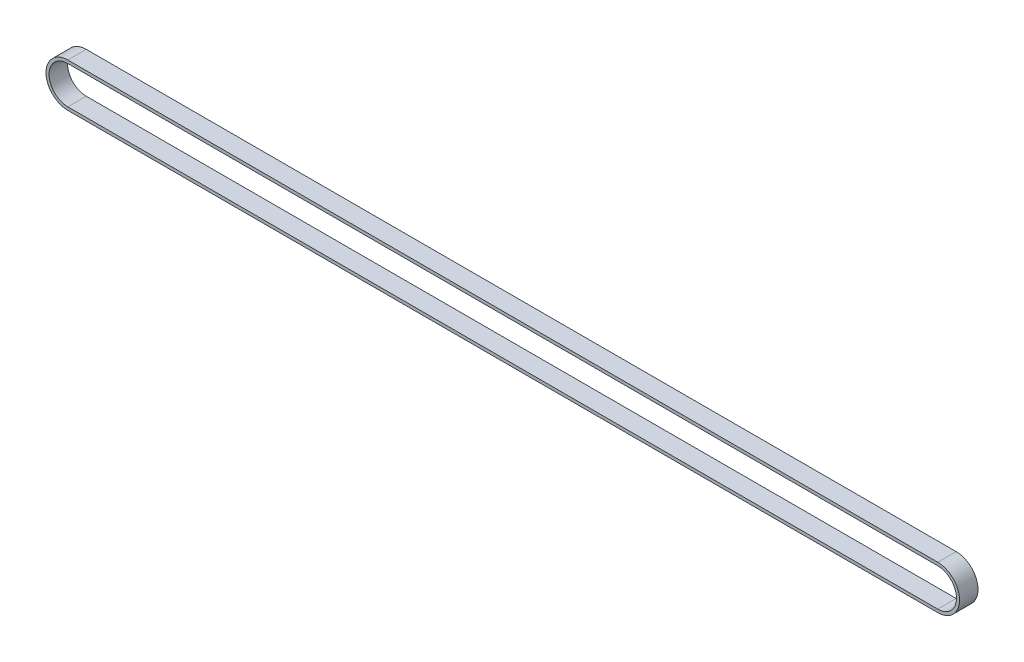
ISO-10303-21;
HEADER;
FILE_DESCRIPTION(('STEP AP214'),'2;1');
FILE_NAME('part.step','',(''),(''),'','','');
FILE_SCHEMA(('AUTOMOTIVE_DESIGN { 1 0 10303 214 1 1 1 1 }'));
ENDSEC;
DATA;
#1=APPLICATION_CONTEXT('core data for automotive mechanical design processes');
#2=APPLICATION_PROTOCOL_DEFINITION('international standard','automotive_design',2000,#1);
#3=PRODUCT_CONTEXT('',#1,'mechanical');
#4=PRODUCT('Part','Part','',(#3));
#5=PRODUCT_RELATED_PRODUCT_CATEGORY('part','',(#4));
#6=PRODUCT_DEFINITION_FORMATION('','',#4);
#7=PRODUCT_DEFINITION_CONTEXT('part definition',#1,'design');
#8=PRODUCT_DEFINITION('design','',#6,#7);
#9=PRODUCT_DEFINITION_SHAPE('','',#8);
#10=(LENGTH_UNIT() NAMED_UNIT(*) SI_UNIT(.MILLI.,.METRE.));
#11=(NAMED_UNIT(*) PLANE_ANGLE_UNIT() SI_UNIT($,.RADIAN.));
#12=(NAMED_UNIT(*) SI_UNIT($,.STERADIAN.) SOLID_ANGLE_UNIT());
#13=UNCERTAINTY_MEASURE_WITH_UNIT(LENGTH_MEASURE(1.E-05),#10,'distance_accuracy_value','');
#14=(GEOMETRIC_REPRESENTATION_CONTEXT(3) GLOBAL_UNCERTAINTY_ASSIGNED_CONTEXT((#13)) GLOBAL_UNIT_ASSIGNED_CONTEXT((#10,
#11,#12)) REPRESENTATION_CONTEXT('',''));
#15=CARTESIAN_POINT('',(0.,0.,0.));
#16=DIRECTION('',(0.,0.,1.));
#17=DIRECTION('',(1.,0.,0.));
#18=AXIS2_PLACEMENT_3D('',#15,#16,#17);
#19=CARTESIAN_POINT('',(0.,0.,6.));
#20=DIRECTION('',(0.,0.,1.));
#21=DIRECTION('',(1.,0.,0.));
#22=AXIS2_PLACEMENT_3D('',#19,#20,#21);
#23=PLANE('',#22);
#24=CARTESIAN_POINT('',(0.,0.,6.));
#25=DIRECTION('',(0.,0.,1.));
#26=DIRECTION('',(1.,0.,0.));
#27=AXIS2_PLACEMENT_3D('',#24,#25,#26);
#28=CIRCLE('',#27,7.1);
#29=CARTESIAN_POINT('',(0.,7.1,6.));
#30=VERTEX_POINT('',#29);
#31=CARTESIAN_POINT('',(0.,-7.1,6.));
#32=VERTEX_POINT('',#31);
#33=EDGE_CURVE('E136',#30,#32,#28,.T.);
#34=ORIENTED_EDGE('',*,*,#33,.T.);
#35=DIRECTION('',(1.,0.,0.));
#36=VECTOR('',#35,1.);
#37=CARTESIAN_POINT('',(0.,-7.1,6.));
#38=LINE('',#37,#36);
#39=CARTESIAN_POINT('',(283.,-7.1,6.));
#40=VERTEX_POINT('',#39);
#41=EDGE_CURVE('E139',#32,#40,#38,.T.);
#42=ORIENTED_EDGE('',*,*,#41,.T.);
#43=CARTESIAN_POINT('',(283.,0.,6.));
#44=DIRECTION('',(0.,0.,1.));
#45=DIRECTION('',(1.,0.,0.));
#46=AXIS2_PLACEMENT_3D('',#43,#44,#45);
#47=CIRCLE('',#46,7.1);
#48=CARTESIAN_POINT('',(283.,7.1,6.));
#49=VERTEX_POINT('',#48);
#50=EDGE_CURVE('E142',#40,#49,#47,.T.);
#51=ORIENTED_EDGE('',*,*,#50,.T.);
#52=DIRECTION('',(-1.,0.,0.));
#53=VECTOR('',#52,1.);
#54=CARTESIAN_POINT('',(0.,7.1,6.));
#55=LINE('',#54,#53);
#56=EDGE_CURVE('E144',#49,#30,#55,.T.);
#57=ORIENTED_EDGE('',*,*,#56,.T.);
#58=EDGE_LOOP('',(#34,#42,#51,#57));
#59=FACE_BOUND('',#58,.T.);
#60=DIRECTION('',(1.,0.,0.));
#61=VECTOR('',#60,1.);
#62=CARTESIAN_POINT('',(0.,-6.1,6.));
#63=LINE('',#62,#61);
#64=CARTESIAN_POINT('',(0.,-6.1,6.));
#65=VERTEX_POINT('',#64);
#66=CARTESIAN_POINT('',(283.,-6.1,6.));
#67=VERTEX_POINT('',#66);
#68=EDGE_CURVE('E108',#65,#67,#63,.T.);
#69=ORIENTED_EDGE('',*,*,#68,.F.);
#70=CARTESIAN_POINT('',(0.,0.,6.));
#71=DIRECTION('',(0.,0.,1.));
#72=DIRECTION('',(1.,0.,0.));
#73=AXIS2_PLACEMENT_3D('',#70,#71,#72);
#74=CIRCLE('',#73,6.1);
#75=CARTESIAN_POINT('',(0.,6.1,6.));
#76=VERTEX_POINT('',#75);
#77=EDGE_CURVE('E100',#76,#65,#74,.T.);
#78=ORIENTED_EDGE('',*,*,#77,.F.);
#79=DIRECTION('',(-1.,0.,0.));
#80=VECTOR('',#79,1.);
#81=CARTESIAN_POINT('',(0.,6.1,6.));
#82=LINE('',#81,#80);
#83=CARTESIAN_POINT('',(283.,6.1,6.));
#84=VERTEX_POINT('',#83);
#85=EDGE_CURVE('E122',#84,#76,#82,.T.);
#86=ORIENTED_EDGE('',*,*,#85,.F.);
#87=CARTESIAN_POINT('',(283.,0.,6.));
#88=DIRECTION('',(0.,0.,1.));
#89=DIRECTION('',(1.,0.,0.));
#90=AXIS2_PLACEMENT_3D('',#87,#88,#89);
#91=CIRCLE('',#90,6.1);
#92=EDGE_CURVE('E120',#67,#84,#91,.T.);
#93=ORIENTED_EDGE('',*,*,#92,.F.);
#94=EDGE_LOOP('',(#69,#78,#86,#93));
#95=FACE_BOUND('',#94,.T.);
#96=ADVANCED_FACE('F35',(#59,#95),#23,.T.);
#97=CARTESIAN_POINT('',(0.,0.,0.));
#98=DIRECTION('',(0.,0.,1.));
#99=DIRECTION('',(1.,0.,0.));
#100=AXIS2_PLACEMENT_3D('',#97,#98,#99);
#101=PLANE('',#100);
#102=CARTESIAN_POINT('',(0.,0.,0.));
#103=DIRECTION('',(0.,0.,1.));
#104=DIRECTION('',(1.,0.,0.));
#105=AXIS2_PLACEMENT_3D('',#102,#103,#104);
#106=CIRCLE('',#105,7.1);
#107=CARTESIAN_POINT('',(0.,7.1,0.));
#108=VERTEX_POINT('',#107);
#109=CARTESIAN_POINT('',(0.,-7.1,0.));
#110=VERTEX_POINT('',#109);
#111=EDGE_CURVE('E116',#108,#110,#106,.T.);
#112=ORIENTED_EDGE('',*,*,#111,.F.);
#113=DIRECTION('',(-1.,0.,0.));
#114=VECTOR('',#113,1.);
#115=CARTESIAN_POINT('',(0.,7.1,0.));
#116=LINE('',#115,#114);
#117=CARTESIAN_POINT('',(283.,7.1,0.));
#118=VERTEX_POINT('',#117);
#119=EDGE_CURVE('E140',#118,#108,#116,.T.);
#120=ORIENTED_EDGE('',*,*,#119,.F.);
#121=CARTESIAN_POINT('',(283.,0.,0.));
#122=DIRECTION('',(0.,0.,1.));
#123=DIRECTION('',(1.,0.,0.));
#124=AXIS2_PLACEMENT_3D('',#121,#122,#123);
#125=CIRCLE('',#124,7.1);
#126=CARTESIAN_POINT('',(283.,-7.1,0.));
#127=VERTEX_POINT('',#126);
#128=EDGE_CURVE('E151',#127,#118,#125,.T.);
#129=ORIENTED_EDGE('',*,*,#128,.F.);
#130=DIRECTION('',(1.,0.,0.));
#131=VECTOR('',#130,1.);
#132=CARTESIAN_POINT('',(0.,-7.1,0.));
#133=LINE('',#132,#131);
#134=EDGE_CURVE('E149',#110,#127,#133,.T.);
#135=ORIENTED_EDGE('',*,*,#134,.F.);
#136=EDGE_LOOP('',(#112,#120,#129,#135));
#137=FACE_BOUND('',#136,.T.);
#138=CARTESIAN_POINT('',(0.,0.,0.));
#139=DIRECTION('',(0.,0.,1.));
#140=DIRECTION('',(1.,0.,0.));
#141=AXIS2_PLACEMENT_3D('',#138,#139,#140);
#142=CIRCLE('',#141,6.1);
#143=CARTESIAN_POINT('',(0.,6.1,0.));
#144=VERTEX_POINT('',#143);
#145=CARTESIAN_POINT('',(0.,-6.1,0.));
#146=VERTEX_POINT('',#145);
#147=EDGE_CURVE('E58',#144,#146,#142,.T.);
#148=ORIENTED_EDGE('',*,*,#147,.T.);
#149=DIRECTION('',(1.,0.,0.));
#150=VECTOR('',#149,1.);
#151=CARTESIAN_POINT('',(0.,-6.1,0.));
#152=LINE('',#151,#150);
#153=CARTESIAN_POINT('',(283.,-6.1,0.));
#154=VERTEX_POINT('',#153);
#155=EDGE_CURVE('E115',#146,#154,#152,.T.);
#156=ORIENTED_EDGE('',*,*,#155,.T.);
#157=CARTESIAN_POINT('',(283.,0.,0.));
#158=DIRECTION('',(0.,0.,1.));
#159=DIRECTION('',(1.,0.,0.));
#160=AXIS2_PLACEMENT_3D('',#157,#158,#159);
#161=CIRCLE('',#160,6.1);
#162=CARTESIAN_POINT('',(283.,6.1,0.));
#163=VERTEX_POINT('',#162);
#164=EDGE_CURVE('E128',#154,#163,#161,.T.);
#165=ORIENTED_EDGE('',*,*,#164,.T.);
#166=DIRECTION('',(-1.,0.,0.));
#167=VECTOR('',#166,1.);
#168=CARTESIAN_POINT('',(0.,6.1,0.));
#169=LINE('',#168,#167);
#170=EDGE_CURVE('E109',#163,#144,#169,.T.);
#171=ORIENTED_EDGE('',*,*,#170,.T.);
#172=EDGE_LOOP('',(#148,#156,#165,#171));
#173=FACE_BOUND('',#172,.T.);
#174=ADVANCED_FACE('F169',(#137,#173),#101,.F.);
#175=CARTESIAN_POINT('',(0.,0.,6.));
#176=DIRECTION('',(0.,0.,-1.));
#177=DIRECTION('',(-1.,0.,0.));
#178=AXIS2_PLACEMENT_3D('',#175,#176,#177);
#179=CYLINDRICAL_SURFACE('',#178,7.1);
#180=ORIENTED_EDGE('',*,*,#111,.T.);
#181=DIRECTION('',(0.,0.,-1.));
#182=VECTOR('',#181,1.);
#183=CARTESIAN_POINT('',(0.,-7.1,6.));
#184=LINE('',#183,#182);
#185=EDGE_CURVE('E11',#32,#110,#184,.T.);
#186=ORIENTED_EDGE('',*,*,#185,.F.);
#187=ORIENTED_EDGE('',*,*,#33,.F.);
#188=DIRECTION('',(0.,0.,-1.));
#189=VECTOR('',#188,1.);
#190=CARTESIAN_POINT('',(0.,7.1,6.));
#191=LINE('',#190,#189);
#192=EDGE_CURVE('E146',#30,#108,#191,.T.);
#193=ORIENTED_EDGE('',*,*,#192,.T.);
#194=EDGE_LOOP('',(#180,#186,#187,#193));
#195=FACE_BOUND('',#194,.T.);
#196=ADVANCED_FACE('F37',(#195),#179,.T.);
#197=CARTESIAN_POINT('',(0.,-7.1,6.));
#198=DIRECTION('',(0.,1.,0.));
#199=DIRECTION('',(0.,0.,1.));
#200=AXIS2_PLACEMENT_3D('',#197,#198,#199);
#201=PLANE('',#200);
#202=ORIENTED_EDGE('',*,*,#134,.T.);
#203=DIRECTION('',(0.,0.,-1.));
#204=VECTOR('',#203,1.);
#205=CARTESIAN_POINT('',(283.,-7.1,6.));
#206=LINE('',#205,#204);
#207=EDGE_CURVE('E43',#40,#127,#206,.T.);
#208=ORIENTED_EDGE('',*,*,#207,.F.);
#209=ORIENTED_EDGE('',*,*,#41,.F.);
#210=ORIENTED_EDGE('',*,*,#185,.T.);
#211=EDGE_LOOP('',(#202,#208,#209,#210));
#212=FACE_BOUND('',#211,.T.);
#213=ADVANCED_FACE('F179',(#212),#201,.F.);
#214=CARTESIAN_POINT('',(283.,0.,6.));
#215=DIRECTION('',(0.,0.,-1.));
#216=DIRECTION('',(-1.,0.,0.));
#217=AXIS2_PLACEMENT_3D('',#214,#215,#216);
#218=CYLINDRICAL_SURFACE('',#217,7.1);
#219=ORIENTED_EDGE('',*,*,#128,.T.);
#220=DIRECTION('',(0.,0.,-1.));
#221=VECTOR('',#220,1.);
#222=CARTESIAN_POINT('',(283.,7.1,6.));
#223=LINE('',#222,#221);
#224=EDGE_CURVE('E156',#49,#118,#223,.T.);
#225=ORIENTED_EDGE('',*,*,#224,.F.);
#226=ORIENTED_EDGE('',*,*,#50,.F.);
#227=ORIENTED_EDGE('',*,*,#207,.T.);
#228=EDGE_LOOP('',(#219,#225,#226,#227));
#229=FACE_BOUND('',#228,.T.);
#230=ADVANCED_FACE('F163',(#229),#218,.T.);
#231=CARTESIAN_POINT('',(0.,7.1,6.));
#232=DIRECTION('',(0.,-1.,0.));
#233=DIRECTION('',(0.,0.,-1.));
#234=AXIS2_PLACEMENT_3D('',#231,#232,#233);
#235=PLANE('',#234);
#236=ORIENTED_EDGE('',*,*,#119,.T.);
#237=ORIENTED_EDGE('',*,*,#192,.F.);
#238=ORIENTED_EDGE('',*,*,#56,.F.);
#239=ORIENTED_EDGE('',*,*,#224,.T.);
#240=EDGE_LOOP('',(#236,#237,#238,#239));
#241=FACE_BOUND('',#240,.T.);
#242=ADVANCED_FACE('F173',(#241),#235,.F.);
#243=CARTESIAN_POINT('',(0.,0.,6.));
#244=DIRECTION('',(0.,0.,-1.));
#245=DIRECTION('',(-1.,0.,0.));
#246=AXIS2_PLACEMENT_3D('',#243,#244,#245);
#247=CYLINDRICAL_SURFACE('',#246,6.1);
#248=ORIENTED_EDGE('',*,*,#147,.F.);
#249=DIRECTION('',(0.,0.,-1.));
#250=VECTOR('',#249,1.);
#251=CARTESIAN_POINT('',(0.,6.1,6.));
#252=LINE('',#251,#250);
#253=EDGE_CURVE('E104',#76,#144,#252,.T.);
#254=ORIENTED_EDGE('',*,*,#253,.F.);
#255=ORIENTED_EDGE('',*,*,#77,.T.);
#256=DIRECTION('',(0.,0.,-1.));
#257=VECTOR('',#256,1.);
#258=CARTESIAN_POINT('',(0.,-6.1,6.));
#259=LINE('',#258,#257);
#260=EDGE_CURVE('E103',#65,#146,#259,.T.);
#261=ORIENTED_EDGE('',*,*,#260,.T.);
#262=EDGE_LOOP('',(#248,#254,#255,#261));
#263=FACE_BOUND('',#262,.T.);
#264=ADVANCED_FACE('F102',(#263),#247,.F.);
#265=CARTESIAN_POINT('',(0.,-6.1,6.));
#266=DIRECTION('',(0.,1.,0.));
#267=DIRECTION('',(0.,0.,1.));
#268=AXIS2_PLACEMENT_3D('',#265,#266,#267);
#269=PLANE('',#268);
#270=ORIENTED_EDGE('',*,*,#155,.F.);
#271=ORIENTED_EDGE('',*,*,#260,.F.);
#272=ORIENTED_EDGE('',*,*,#68,.T.);
#273=DIRECTION('',(0.,0.,-1.));
#274=VECTOR('',#273,1.);
#275=CARTESIAN_POINT('',(283.,-6.1,6.));
#276=LINE('',#275,#274);
#277=EDGE_CURVE('E117',#67,#154,#276,.T.);
#278=ORIENTED_EDGE('',*,*,#277,.T.);
#279=EDGE_LOOP('',(#270,#271,#272,#278));
#280=FACE_BOUND('',#279,.T.);
#281=ADVANCED_FACE('F112',(#280),#269,.T.);
#282=CARTESIAN_POINT('',(283.,0.,6.));
#283=DIRECTION('',(0.,0.,-1.));
#284=DIRECTION('',(-1.,0.,0.));
#285=AXIS2_PLACEMENT_3D('',#282,#283,#284);
#286=CYLINDRICAL_SURFACE('',#285,6.1);
#287=ORIENTED_EDGE('',*,*,#164,.F.);
#288=ORIENTED_EDGE('',*,*,#277,.F.);
#289=ORIENTED_EDGE('',*,*,#92,.T.);
#290=DIRECTION('',(0.,0.,-1.));
#291=VECTOR('',#290,1.);
#292=CARTESIAN_POINT('',(283.,6.1,6.));
#293=LINE('',#292,#291);
#294=EDGE_CURVE('E50',#84,#163,#293,.T.);
#295=ORIENTED_EDGE('',*,*,#294,.T.);
#296=EDGE_LOOP('',(#287,#288,#289,#295));
#297=FACE_BOUND('',#296,.T.);
#298=ADVANCED_FACE('F202',(#297),#286,.F.);
#299=CARTESIAN_POINT('',(0.,6.1,6.));
#300=DIRECTION('',(0.,-1.,0.));
#301=DIRECTION('',(0.,0.,-1.));
#302=AXIS2_PLACEMENT_3D('',#299,#300,#301);
#303=PLANE('',#302);
#304=ORIENTED_EDGE('',*,*,#170,.F.);
#305=ORIENTED_EDGE('',*,*,#294,.F.);
#306=ORIENTED_EDGE('',*,*,#85,.T.);
#307=ORIENTED_EDGE('',*,*,#253,.T.);
#308=EDGE_LOOP('',(#304,#305,#306,#307));
#309=FACE_BOUND('',#308,.T.);
#310=ADVANCED_FACE('F206',(#309),#303,.T.);
#311=CLOSED_SHELL('',(#96,#174,#196,#213,#230,#242,#264,#281,#298,#310));
#312=MANIFOLD_SOLID_BREP('B2',#311);
#313=ADVANCED_BREP_SHAPE_REPRESENTATION('',(#18,#312),#14);
#314=SHAPE_DEFINITION_REPRESENTATION(#9,#313);
ENDSEC;
END-ISO-10303-21;
